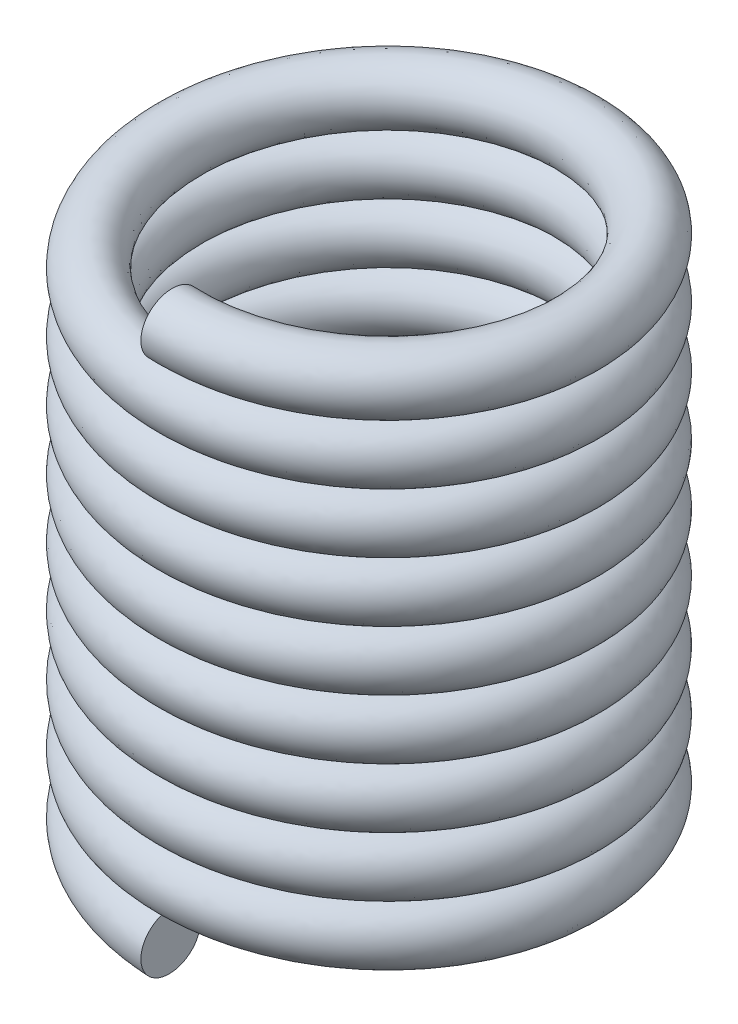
from build123d import *

# Parameters (mm, degrees)
SKETCH2_R = 1.5


with BuildPart() as part:
    # Sweep2: sweep along a curve in space
    with BuildLine() as sweep2_path:
        add(Edge.make_bspline(
            [(0, 0, 10), (-1.300621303, 0.062100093, 10), (-3.93026777, 0.187685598, 9.479318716), (-7.254136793, 0.374950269, 7.255156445), (-9.479591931, 0.562513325, 3.926462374), (-10.260267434, 0.749996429, 0), (-9.479338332, 0.937500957, -3.926462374), (-7.255151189, 1.124999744, -7.255156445), (-3.926463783, 1.312500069, -9.479318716), (3.77e-07, 1.499999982, -10.260340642), (3.926462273, 1.687500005, -9.479318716), (7.255156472, 1.874999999, -7.255156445), (9.479318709, 2.0625, -3.926462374), (10.260340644, 2.25, 0), (9.479318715, 2.4375, 3.926462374), (7.255156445, 2.625, 7.255156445), (3.926462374, 2.8125, 9.479318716), (0, 3, 10.260340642), (-3.926462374, 3.1875, 9.479318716), (-7.255156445, 3.375, 7.255156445), (-9.479318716, 3.5625, 3.926462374), (-10.260340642, 3.75, 0), (-9.479318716, 3.9375, -3.926462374), (-7.255156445, 4.125, -7.255156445), (-3.926462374, 4.3125, -9.479318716), (0, 4.5, -10.260340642), (3.926462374, 4.6875, -9.479318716), (7.255156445, 4.875, -7.255156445), (9.479318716, 5.0625, -3.926462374), (10.260340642, 5.25, 0), (9.479318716, 5.4375, 3.926462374), (7.255156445, 5.625, 7.255156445), (3.926462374, 5.8125, 9.479318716), (0, 6, 10.260340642), (-3.926462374, 6.1875, 9.479318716), (-7.255156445, 6.375, 7.255156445), (-9.479318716, 6.5625, 3.926462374), (-10.260340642, 6.75, 0), (-9.479318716, 6.9375, -3.926462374), (-7.255156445, 7.125, -7.255156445), (-3.926462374, 7.3125, -9.479318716), (0, 7.5, -10.260340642), (3.926462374, 7.6875, -9.479318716), (7.255156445, 7.875, -7.255156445), (9.479318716, 8.0625, -3.926462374), (10.260340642, 8.25, 0), (9.479318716, 8.4375, 3.926462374), (7.255156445, 8.625, 7.255156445), (3.926462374, 8.8125, 9.479318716), (0, 9, 10.260340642), (-3.926462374, 9.1875, 9.479318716), (-7.255156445, 9.375, 7.255156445), (-9.479318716, 9.5625, 3.926462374), (-10.260340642, 9.75, 0), (-9.479318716, 9.9375, -3.926462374), (-7.255156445, 10.125, -7.255156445), (-3.926462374, 10.3125, -9.479318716), (0, 10.5, -10.260340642), (3.926462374, 10.6875, -9.479318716), (7.255156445, 10.875, -7.255156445), (9.479318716, 11.0625, -3.926462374), (10.260340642, 11.25, 0), (9.479318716, 11.4375, 3.926462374), (7.255156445, 11.625, 7.255156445), (3.926462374, 11.8125, 9.479318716), (0, 12, 10.260340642), (-3.926462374, 12.1875, 9.479318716), (-7.255156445, 12.375, 7.255156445), (-9.479318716, 12.5625, 3.926462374), (-10.260340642, 12.75, 0), (-9.479318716, 12.9375, -3.926462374), (-7.255156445, 13.125, -7.255156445), (-3.926462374, 13.3125, -9.479318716), (0, 13.5, -10.260340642), (3.926462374, 13.6875, -9.479318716), (7.255156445, 13.875, -7.255156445), (9.479318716, 14.0625, -3.926462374), (10.260340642, 14.25, 0), (9.479318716, 14.4375, 3.926462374), (7.255156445, 14.625, 7.255156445), (3.926462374, 14.8125, 9.479318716), (0, 15, 10.260340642), (-3.926462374, 15.1875, 9.479318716), (-7.255156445, 15.375, 7.255156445), (-9.479318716, 15.5625, 3.926462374), (-10.260340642, 15.75, 0), (-9.479318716, 15.9375, -3.926462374), (-7.255156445, 16.125, -7.255156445), (-3.926462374, 16.3125, -9.479318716), (0, 16.5, -10.260340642), (3.926462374, 16.6875, -9.479318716), (7.255156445, 16.875, -7.255156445), (9.479318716, 17.0625, -3.926462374), (10.260340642, 17.25, 0), (9.479318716, 17.4375, 3.926462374), (7.255156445, 17.625, 7.255156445), (3.926462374, 17.8125, 9.479318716), (0, 18, 10.260340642), (-3.926462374, 18.1875, 9.479318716), (-7.255156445, 18.375, 7.255156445), (-9.479318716, 18.5625, 3.926462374), (-10.260340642, 18.75, 0), (-9.479318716, 18.9375, -3.926462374), (-7.255156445, 19.125, -7.255156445), (-3.926462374, 19.3125, -9.479318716), (0, 19.5, -10.260340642), (3.926462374, 19.6875, -9.479318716), (7.255156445, 19.875, -7.255156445), (9.479318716, 20.0625, -3.926462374), (10.260340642, 20.25, 0), (9.479318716, 20.4375, 3.926462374), (7.255156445, 20.625, 7.255156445), (3.926462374, 20.8125, 9.479318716), (0, 21, 10.260340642), (-3.926462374, 21.1875, 9.479318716), (-7.255156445, 21.375, 7.255156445), (-9.479318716, 21.5625, 3.926462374), (-10.260340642, 21.75, 0), (-9.479318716, 21.9375, -3.926462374), (-7.255156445, 22.125, -7.255156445), (-3.926462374, 22.3125, -9.479318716), (0, 22.5, -10.260340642), (3.926462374, 22.6875, -9.479318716), (7.255156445, 22.875, -7.255156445), (9.479318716, 23.0625, -3.926462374), (10.260340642, 23.25, 0), (9.479318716, 23.4375, 3.926462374), (7.255156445, 23.625, 7.255156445), (3.926462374, 23.8125, 9.479318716), (0, 24, 10.260340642), (-3.926462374, 24.1875, 9.479318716), (-7.255156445, 24.375, 7.255156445), (-9.479318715, 24.5625, 3.926462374), (-10.260340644, 24.75, 0), (-9.479318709, 24.9375, -3.926462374), (-7.255156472, 25.125000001, -7.255156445), (-3.926462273, 25.312499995, -9.479318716), (-3.77e-07, 25.500000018, -10.260340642), (3.926463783, 25.687499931, -9.479318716), (7.255151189, 25.875000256, -7.255156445), (9.479338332, 26.062499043, -3.926462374), (10.260267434, 26.250003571, 0), (9.479591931, 26.437486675, 3.926462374), (7.254136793, 26.625049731, 7.255156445), (3.93026777, 26.812314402, 9.479318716), (1.300621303, 26.937899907, 10), (0, 27, 10)],
            knots=[0, 0, 0, 0, 0.006944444, 0.013888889, 0.020833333, 0.027777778, 0.034722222, 0.041666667, 0.048611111, 0.055555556, 0.0625, 0.069444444, 0.076388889, 0.083333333, 0.090277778, 0.097222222, 0.104166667, 0.111111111, 0.118055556, 0.125, 0.131944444, 0.138888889, 0.145833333, 0.152777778, 0.159722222, 0.166666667, 0.173611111, 0.180555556, 0.1875, 0.194444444, 0.201388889, 0.208333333, 0.215277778, 0.222222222, 0.229166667, 0.236111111, 0.243055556, 0.25, 0.256944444, 0.263888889, 0.270833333, 0.277777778, 0.284722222, 0.291666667, 0.298611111, 0.305555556, 0.3125, 0.319444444, 0.326388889, 0.333333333, 0.340277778, 0.347222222, 0.354166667, 0.361111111, 0.368055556, 0.375, 0.381944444, 0.388888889, 0.395833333, 0.402777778, 0.409722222, 0.416666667, 0.423611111, 0.430555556, 0.4375, 0.444444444, 0.451388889, 0.458333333, 0.465277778, 0.472222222, 0.479166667, 0.486111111, 0.493055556, 0.5, 0.506944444, 0.513888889, 0.520833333, 0.527777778, 0.534722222, 0.541666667, 0.548611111, 0.555555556, 0.5625, 0.569444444, 0.576388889, 0.583333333, 0.590277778, 0.597222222, 0.604166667, 0.611111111, 0.618055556, 0.625, 0.631944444, 0.638888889, 0.645833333, 0.652777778, 0.659722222, 0.666666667, 0.673611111, 0.680555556, 0.6875, 0.694444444, 0.701388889, 0.708333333, 0.715277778, 0.722222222, 0.729166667, 0.736111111, 0.743055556, 0.75, 0.756944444, 0.763888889, 0.770833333, 0.777777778, 0.784722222, 0.791666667, 0.798611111, 0.805555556, 0.8125, 0.819444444, 0.826388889, 0.833333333, 0.840277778, 0.847222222, 0.854166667, 0.861111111, 0.868055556, 0.875, 0.881944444, 0.888888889, 0.895833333, 0.902777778, 0.909722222, 0.916666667, 0.923611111, 0.930555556, 0.9375, 0.944444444, 0.951388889, 0.958333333, 0.965277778, 0.972222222, 0.979166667, 0.986111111, 0.993055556, 1, 1, 1, 1], degree=3))
    # Sketch2 → Sweep2 (sweep)
    with BuildSketch(Plane(origin=(0, 0, 10), x_dir=(0, 0, 1), z_dir=(-0.9988620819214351, 0.047692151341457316, 0))):
        Circle(SKETCH2_R)
    sweep(path=sweep2_path.line, is_frenet=True)


solid = part.part
